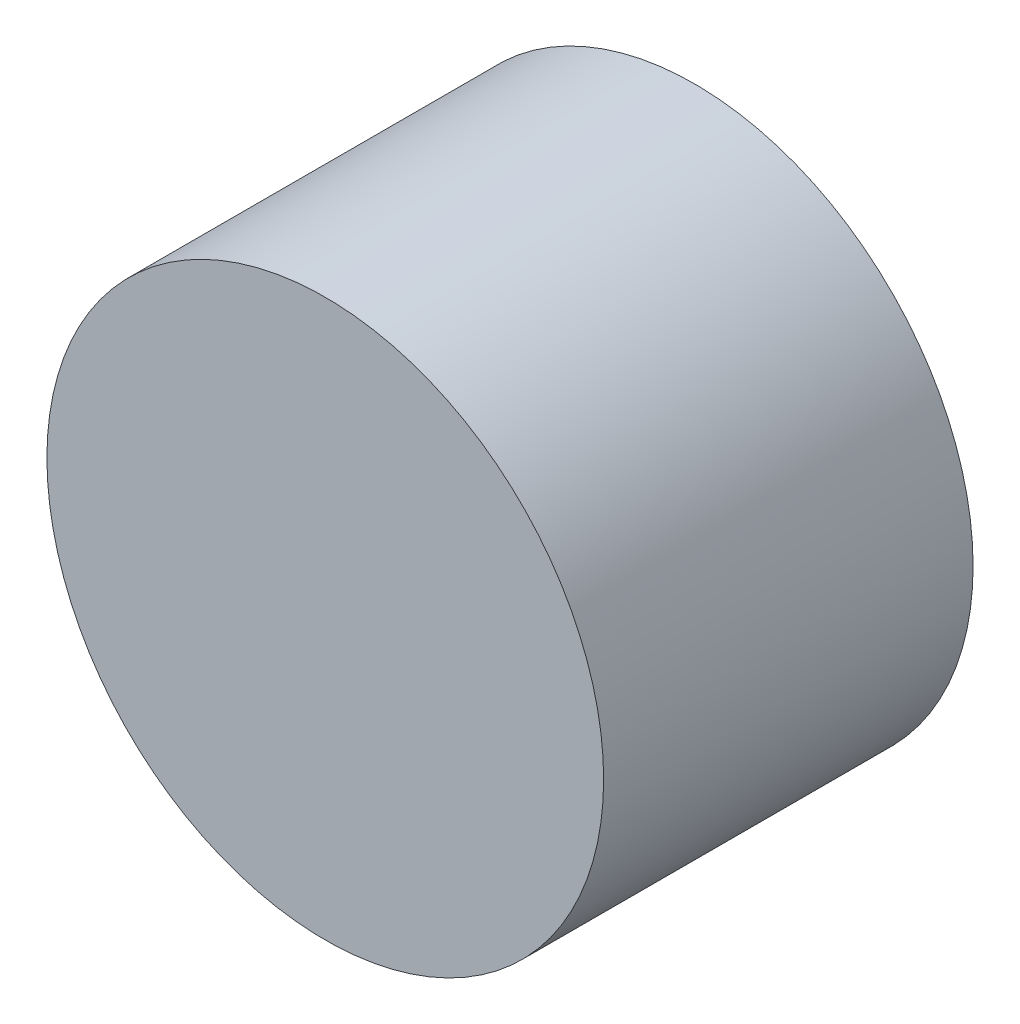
ISO-10303-21;
HEADER;
FILE_DESCRIPTION(('STEP AP214'),'2;1');
FILE_NAME('part.step','',(''),(''),'','','');
FILE_SCHEMA(('AUTOMOTIVE_DESIGN { 1 0 10303 214 1 1 1 1 }'));
ENDSEC;
DATA;
#1=APPLICATION_CONTEXT('core data for automotive mechanical design processes');
#2=APPLICATION_PROTOCOL_DEFINITION('international standard','automotive_design',2000,#1);
#3=PRODUCT_CONTEXT('',#1,'mechanical');
#4=PRODUCT('Part','Part','',(#3));
#5=PRODUCT_RELATED_PRODUCT_CATEGORY('part','',(#4));
#6=PRODUCT_DEFINITION_FORMATION('','',#4);
#7=PRODUCT_DEFINITION_CONTEXT('part definition',#1,'design');
#8=PRODUCT_DEFINITION('design','',#6,#7);
#9=PRODUCT_DEFINITION_SHAPE('','',#8);
#10=(LENGTH_UNIT() NAMED_UNIT(*) SI_UNIT(.MILLI.,.METRE.));
#11=(NAMED_UNIT(*) PLANE_ANGLE_UNIT() SI_UNIT($,.RADIAN.));
#12=(NAMED_UNIT(*) SI_UNIT($,.STERADIAN.) SOLID_ANGLE_UNIT());
#13=UNCERTAINTY_MEASURE_WITH_UNIT(LENGTH_MEASURE(1.E-05),#10,'distance_accuracy_value','');
#14=(GEOMETRIC_REPRESENTATION_CONTEXT(3) GLOBAL_UNCERTAINTY_ASSIGNED_CONTEXT((#13)) GLOBAL_UNIT_ASSIGNED_CONTEXT((#10,
#11,#12)) REPRESENTATION_CONTEXT('',''));
#15=CARTESIAN_POINT('',(0.,0.,0.));
#16=DIRECTION('',(0.,0.,1.));
#17=DIRECTION('',(1.,0.,0.));
#18=AXIS2_PLACEMENT_3D('',#15,#16,#17);
#19=CARTESIAN_POINT('',(0.,0.,10.85));
#20=DIRECTION('',(0.,0.,1.));
#21=DIRECTION('',(1.,0.,0.));
#22=AXIS2_PLACEMENT_3D('',#19,#20,#21);
#23=PLANE('',#22);
#24=CARTESIAN_POINT('',(0.,0.,10.85));
#25=DIRECTION('',(0.,0.,-1.));
#26=DIRECTION('',(-1.,0.,0.));
#27=AXIS2_PLACEMENT_3D('',#24,#25,#26);
#28=CIRCLE('',#27,16.35);
#29=CARTESIAN_POINT('',(-16.35,0.,10.85));
#30=VERTEX_POINT('',#29);
#31=EDGE_CURVE('E10',#30,#30,#28,.T.);
#32=ORIENTED_EDGE('',*,*,#31,.F.);
#33=EDGE_LOOP('',(#32));
#34=FACE_BOUND('',#33,.T.);
#35=ADVANCED_FACE('F15',(#34),#23,.T.);
#36=CARTESIAN_POINT('',(0.,0.,-10.85));
#37=DIRECTION('',(0.,0.,-1.));
#38=DIRECTION('',(-1.,0.,0.));
#39=AXIS2_PLACEMENT_3D('',#36,#37,#38);
#40=PLANE('',#39);
#41=CARTESIAN_POINT('',(0.,0.,-10.85));
#42=DIRECTION('',(0.,0.,1.));
#43=DIRECTION('',(1.,0.,0.));
#44=AXIS2_PLACEMENT_3D('',#41,#42,#43);
#45=CIRCLE('',#44,16.35);
#46=CARTESIAN_POINT('',(16.35,0.,-10.85));
#47=VERTEX_POINT('',#46);
#48=EDGE_CURVE('E22',#47,#47,#45,.T.);
#49=ORIENTED_EDGE('',*,*,#48,.F.);
#50=EDGE_LOOP('',(#49));
#51=FACE_BOUND('',#50,.T.);
#52=ADVANCED_FACE('F26',(#51),#40,.T.);
#53=CARTESIAN_POINT('',(0.,0.,-10.85));
#54=DIRECTION('',(0.,0.,1.));
#55=DIRECTION('',(1.,0.,0.));
#56=AXIS2_PLACEMENT_3D('',#53,#54,#55);
#57=CYLINDRICAL_SURFACE('',#56,16.35);
#58=ORIENTED_EDGE('',*,*,#31,.T.);
#59=EDGE_LOOP('',(#58));
#60=FACE_BOUND('',#59,.T.);
#61=ORIENTED_EDGE('',*,*,#48,.T.);
#62=EDGE_LOOP('',(#61));
#63=FACE_BOUND('',#62,.T.);
#64=ADVANCED_FACE('F17',(#60,#63),#57,.T.);
#65=CLOSED_SHELL('',(#35,#52,#64));
#66=MANIFOLD_SOLID_BREP('B1',#65);
#67=ADVANCED_BREP_SHAPE_REPRESENTATION('',(#18,#66),#14);
#68=SHAPE_DEFINITION_REPRESENTATION(#9,#67);
ENDSEC;
END-ISO-10303-21;
